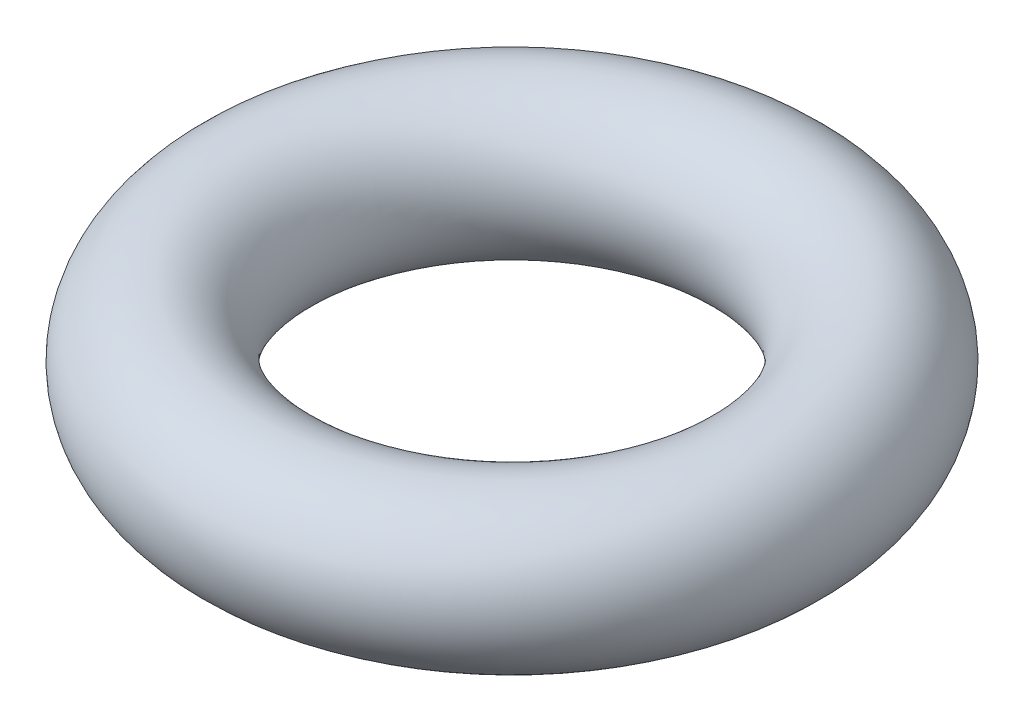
ISO-10303-21;
HEADER;
FILE_DESCRIPTION(('STEP AP214'),'2;1');
FILE_NAME('part.step','',(''),(''),'','','');
FILE_SCHEMA(('AUTOMOTIVE_DESIGN { 1 0 10303 214 1 1 1 1 }'));
ENDSEC;
DATA;
#1=APPLICATION_CONTEXT('core data for automotive mechanical design processes');
#2=APPLICATION_PROTOCOL_DEFINITION('international standard','automotive_design',2000,#1);
#3=PRODUCT_CONTEXT('',#1,'mechanical');
#4=PRODUCT('Part','Part','',(#3));
#5=PRODUCT_RELATED_PRODUCT_CATEGORY('part','',(#4));
#6=PRODUCT_DEFINITION_FORMATION('','',#4);
#7=PRODUCT_DEFINITION_CONTEXT('part definition',#1,'design');
#8=PRODUCT_DEFINITION('design','',#6,#7);
#9=PRODUCT_DEFINITION_SHAPE('','',#8);
#10=(LENGTH_UNIT() NAMED_UNIT(*) SI_UNIT(.MILLI.,.METRE.));
#11=(NAMED_UNIT(*) PLANE_ANGLE_UNIT() SI_UNIT($,.RADIAN.));
#12=(NAMED_UNIT(*) SI_UNIT($,.STERADIAN.) SOLID_ANGLE_UNIT());
#13=UNCERTAINTY_MEASURE_WITH_UNIT(LENGTH_MEASURE(1.E-05),#10,'distance_accuracy_value','');
#14=(GEOMETRIC_REPRESENTATION_CONTEXT(3) GLOBAL_UNCERTAINTY_ASSIGNED_CONTEXT((#13)) GLOBAL_UNIT_ASSIGNED_CONTEXT((#10,
#11,#12)) REPRESENTATION_CONTEXT('',''));
#15=CARTESIAN_POINT('',(0.,0.,0.));
#16=DIRECTION('',(0.,0.,1.));
#17=DIRECTION('',(1.,0.,0.));
#18=AXIS2_PLACEMENT_3D('',#15,#16,#17);
#19=CARTESIAN_POINT('',(0.,0.,0.));
#20=DIRECTION('',(0.,-1.,0.));
#21=DIRECTION('',(0.,0.,-1.));
#22=AXIS2_PLACEMENT_3D('',#19,#20,#21);
#23=TOROIDAL_SURFACE('',#22,2.7,0.800000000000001);
#24=ADVANCED_FACE('F14',(),#23,.T.);
#25=CLOSED_SHELL('',(#24));
#26=MANIFOLD_SOLID_BREP('B1',#25);
#27=ADVANCED_BREP_SHAPE_REPRESENTATION('',(#18,#26),#14);
#28=SHAPE_DEFINITION_REPRESENTATION(#9,#27);
ENDSEC;
END-ISO-10303-21;
